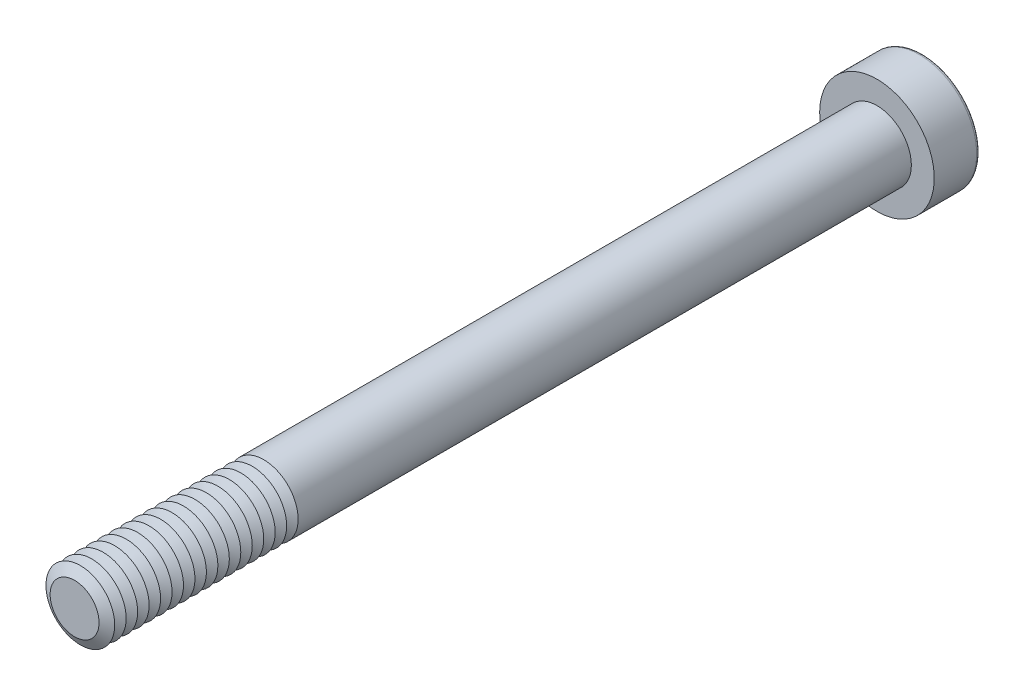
from build123d import *

# Parameters (mm, degrees)
SKETCH1_R           = 3
BOSS_EXTRUDE1_DEPTH = 70
SKETCH2_R           = 5
BOSS_EXTRUDE2_DEPTH = 4
CUT_EXTRUDE1_DEPTH  = 3
FILLET1_R           = 0.3
LPATTERN1_COUNT     = 17
LPATTERN1_PITCH     = 1


with BuildPart() as part:
    # Sketch1 → Boss-Extrude1 (new body)
    with BuildSketch(Plane.XY):
        Circle(SKETCH1_R)
    extrude(amount=BOSS_EXTRUDE1_DEPTH)

    # Sketch2 → Boss-Extrude2 (add)
    with BuildSketch(Plane(origin=(0, 0, 0), x_dir=(-1, 0, 0), z_dir=(0, 0, -1))):
        Circle(SKETCH2_R)
    extrude(amount=BOSS_EXTRUDE2_DEPTH)

    # Sketch3 → Cut-Extrude1 (cut)
    with BuildSketch(Plane(origin=(0, 0, -4), x_dir=(-1, 0, 0), z_dir=(0, 0, -1))):
        Polygon((-1.154700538, 2), (-2.309401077, 0), (-1.154700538, -2), (1.154700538, -2), (2.309401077, 0), (1.154700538, 2), align=None)
    extrude(amount=-CUT_EXTRUDE1_DEPTH, mode=Mode.SUBTRACT)

    # Fillet1
    fillet1_edges = [part.edges().sort_by_distance(p)[0] for p in [
        (5, 0, -4),
    ]]
    fillet(fillet1_edges, radius=FILLET1_R)

    # Cut-Extrude2 cone 1 section (on through the dimple's axis) → Cut-Extrude2 (revolve, cut)
    with BuildSketch(Plane(origin=(0, 0, -1), x_dir=(0, 1, 0), z_dir=(1, 0, 0))):
        Polygon((0, 0), (2, 0), (0, 1.154700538), align=None)
    revolve(axis=Axis((0, 0, -1), (0, 0, 1)), mode=Mode.SUBTRACT)

    # Cut-Extrude3 cone 1 section (on through the dimple's axis) → Cut-Extrude3 (revolve, cut)
    with BuildSketch(Plane(origin=(0, 0, -4), x_dir=(0, 1, 0), z_dir=(1, 0, 0))):
        Polygon((0, 0), (2.309401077, 0), (0, 0.618802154), align=None)
    revolve(axis=Axis((0, 0, -4), (0, 0, 1)), mode=Mode.SUBTRACT)

    # Sketch7 → Cut-Revolve1 (revolve, cut)
    with BuildSketch(Plane(origin=(0, 0, 0), x_dir=(0, 0, -1), z_dir=(1, 0, 0)), mode=Mode.PRIVATE) as cut_revolve1_sk:
        Polygon((-70, 2.133974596), (-69.5, 3), (-70.5, 3), align=None)
    cut_revolve1 = revolve(cut_revolve1_sk.sketch.rotate(Axis((0, 0, 70), (0, 0, -1)), 90), axis=Axis((0, 0, 70), (0, 0, -1)), mode=Mode.SUBTRACT)

    # LPattern1: Cut-Revolve1 ×17
    with Locations(*[(0, 0, -i * LPATTERN1_PITCH) for i in range(1, LPATTERN1_COUNT)]):
        add(cut_revolve1, mode=Mode.SUBTRACT)


solid = part.part
